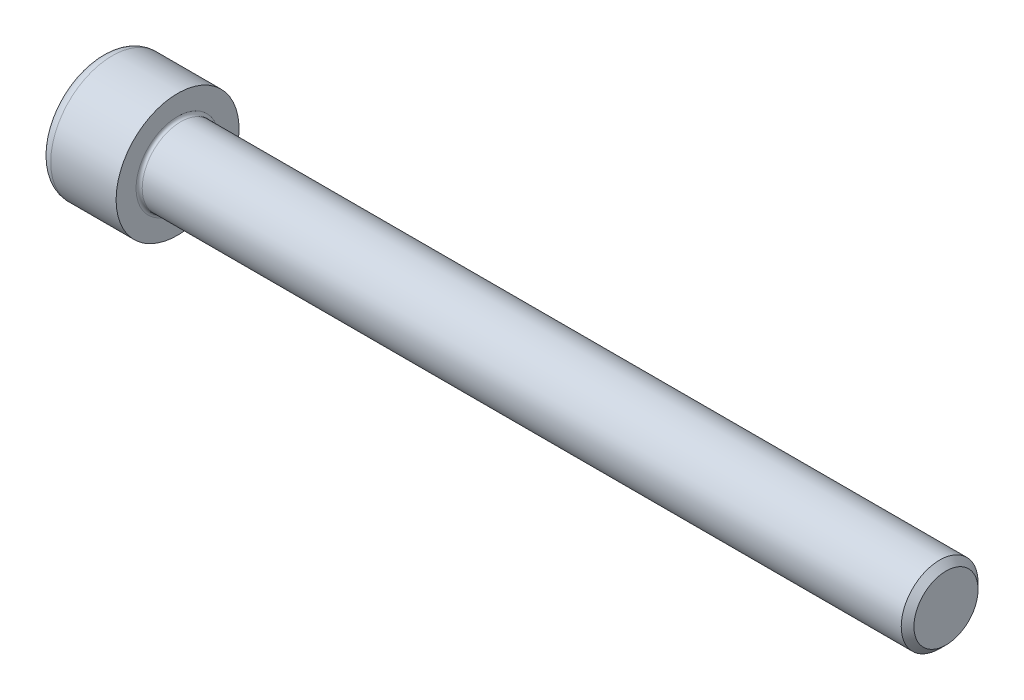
ISO-10303-21;
HEADER;
FILE_DESCRIPTION(('STEP AP214'),'2;1');
FILE_NAME('part.step','',(''),(''),'','','');
FILE_SCHEMA(('AUTOMOTIVE_DESIGN { 1 0 10303 214 1 1 1 1 }'));
ENDSEC;
DATA;
#1=APPLICATION_CONTEXT('core data for automotive mechanical design processes');
#2=APPLICATION_PROTOCOL_DEFINITION('international standard','automotive_design',2000,#1);
#3=PRODUCT_CONTEXT('',#1,'mechanical');
#4=PRODUCT('Part','Part','',(#3));
#5=PRODUCT_RELATED_PRODUCT_CATEGORY('part','',(#4));
#6=PRODUCT_DEFINITION_FORMATION('','',#4);
#7=PRODUCT_DEFINITION_CONTEXT('part definition',#1,'design');
#8=PRODUCT_DEFINITION('design','',#6,#7);
#9=PRODUCT_DEFINITION_SHAPE('','',#8);
#10=(LENGTH_UNIT() NAMED_UNIT(*) SI_UNIT(.MILLI.,.METRE.));
#11=(NAMED_UNIT(*) PLANE_ANGLE_UNIT() SI_UNIT($,.RADIAN.));
#12=(NAMED_UNIT(*) SI_UNIT($,.STERADIAN.) SOLID_ANGLE_UNIT());
#13=UNCERTAINTY_MEASURE_WITH_UNIT(LENGTH_MEASURE(1.E-05),#10,'distance_accuracy_value','');
#14=(GEOMETRIC_REPRESENTATION_CONTEXT(3) GLOBAL_UNCERTAINTY_ASSIGNED_CONTEXT((#13)) GLOBAL_UNIT_ASSIGNED_CONTEXT((#10,
#11,#12)) REPRESENTATION_CONTEXT('',''));
#15=CARTESIAN_POINT('',(0.,0.,0.));
#16=DIRECTION('',(0.,0.,1.));
#17=DIRECTION('',(1.,0.,0.));
#18=AXIS2_PLACEMENT_3D('',#15,#16,#17);
#19=CARTESIAN_POINT('',(0.,0.,0.));
#20=DIRECTION('',(-1.,0.,0.));
#21=DIRECTION('',(0.,0.,1.));
#22=AXIS2_PLACEMENT_3D('',#19,#20,#21);
#23=PLANE('',#22);
#24=DIRECTION('',(0.,-0.499999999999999,0.866025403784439));
#25=VECTOR('',#24,1.);
#26=CARTESIAN_POINT('',(0.,4.68519743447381,0.));
#27=LINE('',#26,#25);
#28=CARTESIAN_POINT('',(0.,4.68519743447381,0.));
#29=VERTEX_POINT('',#28);
#30=CARTESIAN_POINT('',(0.,2.34259871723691,4.05749999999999));
#31=VERTEX_POINT('',#30);
#32=EDGE_CURVE('E259',#29,#31,#27,.T.);
#33=ORIENTED_EDGE('',*,*,#32,.T.);
#34=DIRECTION('',(0.,1.,0.));
#35=VECTOR('',#34,1.);
#36=CARTESIAN_POINT('',(0.,-2.34259871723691,4.0575));
#37=LINE('',#36,#35);
#38=CARTESIAN_POINT('',(0.,-2.34259871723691,4.0575));
#39=VERTEX_POINT('',#38);
#40=EDGE_CURVE('E131',#39,#31,#37,.T.);
#41=ORIENTED_EDGE('',*,*,#40,.F.);
#42=DIRECTION('',(0.,-0.500000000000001,-0.866025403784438));
#43=VECTOR('',#42,1.);
#44=CARTESIAN_POINT('',(0.,-2.34259871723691,4.0575));
#45=LINE('',#44,#43);
#46=CARTESIAN_POINT('',(0.,-4.68519743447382,0.));
#47=VERTEX_POINT('',#46);
#48=EDGE_CURVE('E262',#39,#47,#45,.T.);
#49=ORIENTED_EDGE('',*,*,#48,.T.);
#50=DIRECTION('',(0.,0.499999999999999,-0.866025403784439));
#51=VECTOR('',#50,1.);
#52=CARTESIAN_POINT('',(0.,-4.68519743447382,0.));
#53=LINE('',#52,#51);
#54=CARTESIAN_POINT('',(0.,-2.34259871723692,-4.0575));
#55=VERTEX_POINT('',#54);
#56=EDGE_CURVE('E265',#47,#55,#53,.T.);
#57=ORIENTED_EDGE('',*,*,#56,.T.);
#58=DIRECTION('',(0.,-1.,0.));
#59=VECTOR('',#58,1.);
#60=CARTESIAN_POINT('',(0.,2.3425987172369,-4.05750000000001));
#61=LINE('',#60,#59);
#62=CARTESIAN_POINT('',(0.,2.3425987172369,-4.05750000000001));
#63=VERTEX_POINT('',#62);
#64=EDGE_CURVE('E268',#63,#55,#61,.T.);
#65=ORIENTED_EDGE('',*,*,#64,.F.);
#66=DIRECTION('',(0.,-0.500000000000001,-0.866025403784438));
#67=VECTOR('',#66,1.);
#68=CARTESIAN_POINT('',(0.,4.68519743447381,0.));
#69=LINE('',#68,#67);
#70=EDGE_CURVE('E126',#29,#63,#69,.T.);
#71=ORIENTED_EDGE('',*,*,#70,.F.);
#72=EDGE_LOOP('',(#33,#41,#49,#57,#65,#71));
#73=FACE_BOUND('',#72,.T.);
#74=CARTESIAN_POINT('',(0.,0.,0.));
#75=DIRECTION('',(-1.,0.,0.));
#76=DIRECTION('',(0.,0.,1.));
#77=AXIS2_PLACEMENT_3D('',#74,#75,#76);
#78=CIRCLE('',#77,6.5);
#79=CARTESIAN_POINT('',(0.,0.,6.5));
#80=VERTEX_POINT('',#79);
#81=EDGE_CURVE('E43',#80,#80,#78,.T.);
#82=ORIENTED_EDGE('',*,*,#81,.T.);
#83=EDGE_LOOP('',(#82));
#84=FACE_BOUND('',#83,.T.);
#85=ADVANCED_FACE('F35',(#73,#84),#23,.T.);
#86=CARTESIAN_POINT('',(-31.75,0.,0.));
#87=DIRECTION('',(-1.,0.,0.));
#88=DIRECTION('',(0.,0.,1.));
#89=AXIS2_PLACEMENT_3D('',#86,#87,#88);
#90=CYLINDRICAL_SURFACE('',#89,8.);
#91=CARTESIAN_POINT('',(1.5,0.,0.));
#92=DIRECTION('',(-1.,0.,0.));
#93=DIRECTION('',(0.,0.,1.));
#94=AXIS2_PLACEMENT_3D('',#91,#92,#93);
#95=CIRCLE('',#94,8.);
#96=CARTESIAN_POINT('',(1.5,0.,8.));
#97=VERTEX_POINT('',#96);
#98=EDGE_CURVE('E11',#97,#97,#95,.F.);
#99=ORIENTED_EDGE('',*,*,#98,.T.);
#100=EDGE_LOOP('',(#99));
#101=FACE_BOUND('',#100,.T.);
#102=CARTESIAN_POINT('',(10.,0.,0.));
#103=DIRECTION('',(-1.,0.,0.));
#104=DIRECTION('',(0.,0.,1.));
#105=AXIS2_PLACEMENT_3D('',#102,#103,#104);
#106=CIRCLE('',#105,8.);
#107=CARTESIAN_POINT('',(10.,0.,8.));
#108=VERTEX_POINT('',#107);
#109=EDGE_CURVE('E149',#108,#108,#106,.T.);
#110=ORIENTED_EDGE('',*,*,#109,.T.);
#111=EDGE_LOOP('',(#110));
#112=FACE_BOUND('',#111,.T.);
#113=ADVANCED_FACE('F173',(#101,#112),#90,.T.);
#114=CARTESIAN_POINT('',(10.,8.,0.));
#115=DIRECTION('',(1.,0.,0.));
#116=DIRECTION('',(0.,0.,-1.));
#117=AXIS2_PLACEMENT_3D('',#114,#115,#116);
#118=PLANE('',#117);
#119=CARTESIAN_POINT('',(10.,0.,0.));
#120=DIRECTION('',(1.,0.,0.));
#121=DIRECTION('',(0.,0.,-1.));
#122=AXIS2_PLACEMENT_3D('',#119,#120,#121);
#123=CIRCLE('',#122,5.39999999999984);
#124=CARTESIAN_POINT('',(10.,0.,-5.39999999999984));
#125=VERTEX_POINT('',#124);
#126=EDGE_CURVE('E152',#125,#125,#123,.F.);
#127=ORIENTED_EDGE('',*,*,#126,.T.);
#128=EDGE_LOOP('',(#127));
#129=FACE_BOUND('',#128,.T.);
#130=ORIENTED_EDGE('',*,*,#109,.F.);
#131=EDGE_LOOP('',(#130));
#132=FACE_BOUND('',#131,.T.);
#133=ADVANCED_FACE('F179',(#129,#132),#118,.T.);
#134=CARTESIAN_POINT('',(-31.75,0.,0.));
#135=DIRECTION('',(-1.,0.,0.));
#136=DIRECTION('',(0.,0.,1.));
#137=AXIS2_PLACEMENT_3D('',#134,#135,#136);
#138=CYLINDRICAL_SURFACE('',#137,4.99999999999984);
#139=CARTESIAN_POINT('',(10.4,0.,0.));
#140=DIRECTION('',(1.,0.,0.));
#141=DIRECTION('',(0.,0.,-1.));
#142=AXIS2_PLACEMENT_3D('',#139,#140,#141);
#143=CIRCLE('',#142,4.99999999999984);
#144=CARTESIAN_POINT('',(10.4,0.,-4.99999999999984));
#145=VERTEX_POINT('',#144);
#146=EDGE_CURVE('E155',#145,#145,#143,.T.);
#147=ORIENTED_EDGE('',*,*,#146,.T.);
#148=EDGE_LOOP('',(#147));
#149=FACE_BOUND('',#148,.T.);
#150=CARTESIAN_POINT('',(109.172,0.,0.));
#151=DIRECTION('',(-1.,0.,0.));
#152=DIRECTION('',(0.,0.,1.));
#153=AXIS2_PLACEMENT_3D('',#150,#151,#152);
#154=CIRCLE('',#153,4.99999999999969);
#155=CARTESIAN_POINT('',(109.172,0.,4.99999999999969));
#156=VERTEX_POINT('',#155);
#157=EDGE_CURVE('E146',#156,#156,#154,.T.);
#158=ORIENTED_EDGE('',*,*,#157,.T.);
#159=EDGE_LOOP('',(#158));
#160=FACE_BOUND('',#159,.T.);
#161=ADVANCED_FACE('F185',(#149,#160),#138,.T.);
#162=CARTESIAN_POINT('',(110.,0.,0.));
#163=DIRECTION('',(-1.,0.,0.));
#164=DIRECTION('',(0.,0.,1.));
#165=AXIS2_PLACEMENT_3D('',#162,#163,#164);
#166=CONICAL_SURFACE('',#165,4.172,0.785398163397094);
#167=ORIENTED_EDGE('',*,*,#157,.F.);
#168=EDGE_LOOP('',(#167));
#169=FACE_BOUND('',#168,.T.);
#170=CARTESIAN_POINT('',(110.,0.,0.));
#171=DIRECTION('',(-1.,0.,0.));
#172=DIRECTION('',(0.,0.,1.));
#173=AXIS2_PLACEMENT_3D('',#170,#171,#172);
#174=CIRCLE('',#173,4.172);
#175=CARTESIAN_POINT('',(110.,0.,4.172));
#176=VERTEX_POINT('',#175);
#177=EDGE_CURVE('E142',#176,#176,#174,.T.);
#178=ORIENTED_EDGE('',*,*,#177,.T.);
#179=EDGE_LOOP('',(#178));
#180=FACE_BOUND('',#179,.T.);
#181=ADVANCED_FACE('F189',(#169,#180),#166,.T.);
#182=CARTESIAN_POINT('',(110.,4.172,0.));
#183=DIRECTION('',(1.,0.,0.));
#184=DIRECTION('',(0.,0.,-1.));
#185=AXIS2_PLACEMENT_3D('',#182,#183,#184);
#186=PLANE('',#185);
#187=ORIENTED_EDGE('',*,*,#177,.F.);
#188=EDGE_LOOP('',(#187));
#189=FACE_BOUND('',#188,.T.);
#190=ADVANCED_FACE('F169',(#189),#186,.T.);
#191=CARTESIAN_POINT('',(10.4,0.,0.));
#192=DIRECTION('',(1.,0.,0.));
#193=DIRECTION('',(0.,0.,-1.));
#194=AXIS2_PLACEMENT_3D('',#191,#192,#193);
#195=TOROIDAL_SURFACE('',#194,5.39999999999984,0.4);
#196=ORIENTED_EDGE('',*,*,#146,.F.);
#197=EDGE_LOOP('',(#196));
#198=FACE_BOUND('',#197,.T.);
#199=ORIENTED_EDGE('',*,*,#126,.F.);
#200=EDGE_LOOP('',(#199));
#201=FACE_BOUND('',#200,.T.);
#202=ADVANCED_FACE('F162',(#198,#201),#195,.F.);
#203=CARTESIAN_POINT('',(1.5,0.,0.));
#204=DIRECTION('',(-1.,0.,0.));
#205=DIRECTION('',(0.,0.,1.));
#206=AXIS2_PLACEMENT_3D('',#203,#204,#205);
#207=TOROIDAL_SURFACE('',#206,6.5,1.5);
#208=ORIENTED_EDGE('',*,*,#98,.F.);
#209=EDGE_LOOP('',(#208));
#210=FACE_BOUND('',#209,.T.);
#211=ORIENTED_EDGE('',*,*,#81,.F.);
#212=EDGE_LOOP('',(#211));
#213=FACE_BOUND('',#212,.T.);
#214=ADVANCED_FACE('F37',(#210,#213),#207,.T.);
#215=CARTESIAN_POINT('',(5.,4.68519743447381,0.));
#216=DIRECTION('',(0.,-0.866025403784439,-0.499999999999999));
#217=DIRECTION('',(0.,0.499999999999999,-0.866025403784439));
#218=AXIS2_PLACEMENT_3D('',#215,#216,#217);
#219=PLANE('',#218);
#220=ORIENTED_EDGE('',*,*,#32,.F.);
#221=DIRECTION('',(-1.,0.,0.));
#222=VECTOR('',#221,1.);
#223=CARTESIAN_POINT('',(5.,4.68519743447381,0.));
#224=LINE('',#223,#222);
#225=CARTESIAN_POINT('',(5.,4.68519743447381,0.));
#226=VERTEX_POINT('',#225);
#227=EDGE_CURVE('E249',#226,#29,#224,.T.);
#228=ORIENTED_EDGE('',*,*,#227,.F.);
#229=DIRECTION('',(0.,-0.499999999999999,0.866025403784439));
#230=VECTOR('',#229,1.);
#231=CARTESIAN_POINT('',(5.,4.68519743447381,0.));
#232=LINE('',#231,#230);
#233=CARTESIAN_POINT('',(5.,3.51389807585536,2.02874999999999));
#234=VERTEX_POINT('',#233);
#235=EDGE_CURVE('E118',#226,#234,#232,.T.);
#236=ORIENTED_EDGE('',*,*,#235,.T.);
#237=CARTESIAN_POINT('',(5.,2.34259871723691,4.05749999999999));
#238=VERTEX_POINT('',#237);
#239=EDGE_CURVE('E109',#234,#238,#232,.T.);
#240=ORIENTED_EDGE('',*,*,#239,.T.);
#241=DIRECTION('',(-1.,0.,0.));
#242=VECTOR('',#241,1.);
#243=CARTESIAN_POINT('',(5.,2.34259871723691,4.05749999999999));
#244=LINE('',#243,#242);
#245=EDGE_CURVE('E123',#238,#31,#244,.T.);
#246=ORIENTED_EDGE('',*,*,#245,.T.);
#247=EDGE_LOOP('',(#220,#228,#236,#240,#246));
#248=FACE_BOUND('',#247,.T.);
#249=ADVANCED_FACE('F122',(#248),#219,.T.);
#250=CARTESIAN_POINT('',(5.,-2.34259871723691,4.0575));
#251=DIRECTION('',(0.,0.,1.));
#252=DIRECTION('',(0.,-1.,0.));
#253=AXIS2_PLACEMENT_3D('',#250,#251,#252);
#254=PLANE('',#253);
#255=ORIENTED_EDGE('',*,*,#40,.T.);
#256=ORIENTED_EDGE('',*,*,#245,.F.);
#257=DIRECTION('',(0.,1.,0.));
#258=VECTOR('',#257,1.);
#259=CARTESIAN_POINT('',(5.,-2.34259871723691,4.0575));
#260=LINE('',#259,#258);
#261=CARTESIAN_POINT('',(5.,0.,4.0575));
#262=VERTEX_POINT('',#261);
#263=EDGE_CURVE('E106',#262,#238,#260,.T.);
#264=ORIENTED_EDGE('',*,*,#263,.F.);
#265=CARTESIAN_POINT('',(5.,-2.34259871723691,4.0575));
#266=VERTEX_POINT('',#265);
#267=EDGE_CURVE('E117',#266,#262,#260,.T.);
#268=ORIENTED_EDGE('',*,*,#267,.F.);
#269=DIRECTION('',(-1.,0.,0.));
#270=VECTOR('',#269,1.);
#271=CARTESIAN_POINT('',(5.,-2.34259871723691,4.0575));
#272=LINE('',#271,#270);
#273=EDGE_CURVE('E133',#266,#39,#272,.T.);
#274=ORIENTED_EDGE('',*,*,#273,.T.);
#275=EDGE_LOOP('',(#255,#256,#264,#268,#274));
#276=FACE_BOUND('',#275,.T.);
#277=ADVANCED_FACE('F128',(#276),#254,.F.);
#278=CARTESIAN_POINT('',(5.,-2.34259871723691,4.0575));
#279=DIRECTION('',(0.,0.866025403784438,-0.500000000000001));
#280=DIRECTION('',(0.,0.500000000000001,0.866025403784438));
#281=AXIS2_PLACEMENT_3D('',#278,#279,#280);
#282=PLANE('',#281);
#283=ORIENTED_EDGE('',*,*,#48,.F.);
#284=ORIENTED_EDGE('',*,*,#273,.F.);
#285=DIRECTION('',(0.,-0.500000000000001,-0.866025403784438));
#286=VECTOR('',#285,1.);
#287=CARTESIAN_POINT('',(5.,-2.34259871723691,4.0575));
#288=LINE('',#287,#286);
#289=CARTESIAN_POINT('',(5.,-3.51389807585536,2.02875000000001));
#290=VERTEX_POINT('',#289);
#291=EDGE_CURVE('E288',#266,#290,#288,.T.);
#292=ORIENTED_EDGE('',*,*,#291,.T.);
#293=CARTESIAN_POINT('',(5.,-4.68519743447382,0.));
#294=VERTEX_POINT('',#293);
#295=EDGE_CURVE('E277',#290,#294,#288,.T.);
#296=ORIENTED_EDGE('',*,*,#295,.T.);
#297=DIRECTION('',(-1.,0.,0.));
#298=VECTOR('',#297,1.);
#299=CARTESIAN_POINT('',(5.,-4.68519743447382,0.));
#300=LINE('',#299,#298);
#301=EDGE_CURVE('E138',#294,#47,#300,.T.);
#302=ORIENTED_EDGE('',*,*,#301,.T.);
#303=EDGE_LOOP('',(#283,#284,#292,#296,#302));
#304=FACE_BOUND('',#303,.T.);
#305=ADVANCED_FACE('F203',(#304),#282,.T.);
#306=CARTESIAN_POINT('',(5.,-4.68519743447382,0.));
#307=DIRECTION('',(0.,0.866025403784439,0.499999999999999));
#308=DIRECTION('',(0.,-0.499999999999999,0.866025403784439));
#309=AXIS2_PLACEMENT_3D('',#306,#307,#308);
#310=PLANE('',#309);
#311=ORIENTED_EDGE('',*,*,#56,.F.);
#312=ORIENTED_EDGE('',*,*,#301,.F.);
#313=DIRECTION('',(0.,0.499999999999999,-0.866025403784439));
#314=VECTOR('',#313,1.);
#315=CARTESIAN_POINT('',(5.,-4.68519743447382,0.));
#316=LINE('',#315,#314);
#317=CARTESIAN_POINT('',(5.,-3.51389807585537,-2.02875));
#318=VERTEX_POINT('',#317);
#319=EDGE_CURVE('E255',#294,#318,#316,.T.);
#320=ORIENTED_EDGE('',*,*,#319,.T.);
#321=CARTESIAN_POINT('',(5.,-2.34259871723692,-4.0575));
#322=VERTEX_POINT('',#321);
#323=EDGE_CURVE('E287',#318,#322,#316,.T.);
#324=ORIENTED_EDGE('',*,*,#323,.T.);
#325=DIRECTION('',(-1.,0.,0.));
#326=VECTOR('',#325,1.);
#327=CARTESIAN_POINT('',(5.,-2.34259871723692,-4.0575));
#328=LINE('',#327,#326);
#329=EDGE_CURVE('E248',#322,#55,#328,.T.);
#330=ORIENTED_EDGE('',*,*,#329,.T.);
#331=EDGE_LOOP('',(#311,#312,#320,#324,#330));
#332=FACE_BOUND('',#331,.T.);
#333=ADVANCED_FACE('F206',(#332),#310,.T.);
#334=CARTESIAN_POINT('',(5.,2.3425987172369,-4.05750000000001));
#335=DIRECTION('',(0.,0.,-1.));
#336=DIRECTION('',(0.,1.,0.));
#337=AXIS2_PLACEMENT_3D('',#334,#335,#336);
#338=PLANE('',#337);
#339=ORIENTED_EDGE('',*,*,#64,.T.);
#340=ORIENTED_EDGE('',*,*,#329,.F.);
#341=DIRECTION('',(0.,-1.,0.));
#342=VECTOR('',#341,1.);
#343=CARTESIAN_POINT('',(5.,2.3425987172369,-4.05750000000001));
#344=LINE('',#343,#342);
#345=CARTESIAN_POINT('',(5.,0.,-4.0575));
#346=VERTEX_POINT('',#345);
#347=EDGE_CURVE('E252',#346,#322,#344,.T.);
#348=ORIENTED_EDGE('',*,*,#347,.F.);
#349=CARTESIAN_POINT('',(5.,2.3425987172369,-4.05750000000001));
#350=VERTEX_POINT('',#349);
#351=EDGE_CURVE('E50',#350,#346,#344,.T.);
#352=ORIENTED_EDGE('',*,*,#351,.F.);
#353=DIRECTION('',(-1.,0.,0.));
#354=VECTOR('',#353,1.);
#355=CARTESIAN_POINT('',(5.,2.3425987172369,-4.05750000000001));
#356=LINE('',#355,#354);
#357=EDGE_CURVE('E245',#350,#63,#356,.T.);
#358=ORIENTED_EDGE('',*,*,#357,.T.);
#359=EDGE_LOOP('',(#339,#340,#348,#352,#358));
#360=FACE_BOUND('',#359,.T.);
#361=ADVANCED_FACE('F210',(#360),#338,.F.);
#362=CARTESIAN_POINT('',(5.,4.68519743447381,0.));
#363=DIRECTION('',(0.,0.866025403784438,-0.500000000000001));
#364=DIRECTION('',(0.,0.500000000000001,0.866025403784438));
#365=AXIS2_PLACEMENT_3D('',#362,#363,#364);
#366=PLANE('',#365);
#367=ORIENTED_EDGE('',*,*,#70,.T.);
#368=ORIENTED_EDGE('',*,*,#357,.F.);
#369=DIRECTION('',(0.,-0.500000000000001,-0.866025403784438));
#370=VECTOR('',#369,1.);
#371=CARTESIAN_POINT('',(5.,4.68519743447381,0.));
#372=LINE('',#371,#370);
#373=CARTESIAN_POINT('',(5.,3.51389807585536,-2.02875));
#374=VERTEX_POINT('',#373);
#375=EDGE_CURVE('E235',#374,#350,#372,.T.);
#376=ORIENTED_EDGE('',*,*,#375,.F.);
#377=EDGE_CURVE('E241',#226,#374,#372,.T.);
#378=ORIENTED_EDGE('',*,*,#377,.F.);
#379=ORIENTED_EDGE('',*,*,#227,.T.);
#380=EDGE_LOOP('',(#367,#368,#376,#378,#379));
#381=FACE_BOUND('',#380,.T.);
#382=ADVANCED_FACE('F214',(#381),#366,.F.);
#383=CARTESIAN_POINT('',(5.,7.02779615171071,-4.05750000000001));
#384=DIRECTION('',(1.,0.,0.));
#385=DIRECTION('',(0.,0.,-1.));
#386=AXIS2_PLACEMENT_3D('',#383,#384,#385);
#387=PLANE('',#386);
#388=ORIENTED_EDGE('',*,*,#347,.T.);
#389=ORIENTED_EDGE('',*,*,#323,.F.);
#390=CARTESIAN_POINT('',(5.,0.,0.));
#391=DIRECTION('',(-1.,0.,0.));
#392=DIRECTION('',(0.,0.,1.));
#393=AXIS2_PLACEMENT_3D('',#390,#391,#392);
#394=CIRCLE('',#393,4.0575);
#395=EDGE_CURVE('E283',#346,#318,#394,.T.);
#396=ORIENTED_EDGE('',*,*,#395,.F.);
#397=EDGE_LOOP('',(#388,#389,#396));
#398=FACE_BOUND('',#397,.T.);
#399=ADVANCED_FACE('F218',(#398),#387,.F.);
#400=ORIENTED_EDGE('',*,*,#319,.F.);
#401=ORIENTED_EDGE('',*,*,#295,.F.);
#402=EDGE_CURVE('E136',#318,#290,#394,.T.);
#403=ORIENTED_EDGE('',*,*,#402,.F.);
#404=EDGE_LOOP('',(#400,#401,#403));
#405=FACE_BOUND('',#404,.T.);
#406=ADVANCED_FACE('F221',(#405),#387,.F.);
#407=ORIENTED_EDGE('',*,*,#291,.F.);
#408=ORIENTED_EDGE('',*,*,#267,.T.);
#409=EDGE_CURVE('E132',#290,#262,#394,.T.);
#410=ORIENTED_EDGE('',*,*,#409,.F.);
#411=EDGE_LOOP('',(#407,#408,#410));
#412=FACE_BOUND('',#411,.T.);
#413=ADVANCED_FACE('F226',(#412),#387,.F.);
#414=ORIENTED_EDGE('',*,*,#263,.T.);
#415=ORIENTED_EDGE('',*,*,#239,.F.);
#416=EDGE_CURVE('E112',#262,#234,#394,.T.);
#417=ORIENTED_EDGE('',*,*,#416,.F.);
#418=EDGE_LOOP('',(#414,#415,#417));
#419=FACE_BOUND('',#418,.T.);
#420=ADVANCED_FACE('F108',(#419),#387,.F.);
#421=ORIENTED_EDGE('',*,*,#235,.F.);
#422=ORIENTED_EDGE('',*,*,#377,.T.);
#423=EDGE_CURVE('E143',#234,#374,#394,.T.);
#424=ORIENTED_EDGE('',*,*,#423,.F.);
#425=EDGE_LOOP('',(#421,#422,#424));
#426=FACE_BOUND('',#425,.T.);
#427=ADVANCED_FACE('F229',(#426),#387,.F.);
#428=ORIENTED_EDGE('',*,*,#375,.T.);
#429=ORIENTED_EDGE('',*,*,#351,.T.);
#430=EDGE_CURVE('E238',#374,#346,#394,.T.);
#431=ORIENTED_EDGE('',*,*,#430,.F.);
#432=EDGE_LOOP('',(#428,#429,#431));
#433=FACE_BOUND('',#432,.T.);
#434=ADVANCED_FACE('F199',(#433),#387,.F.);
#435=CARTESIAN_POINT('',(5.,0.,0.));
#436=DIRECTION('',(-1.,0.,0.));
#437=DIRECTION('',(0.,0.,1.));
#438=AXIS2_PLACEMENT_3D('',#435,#436,#437);
#439=CONICAL_SURFACE('',#438,4.0575,1.04719755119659);
#440=CARTESIAN_POINT('',(7.34259871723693,0.,0.));
#441=VERTEX_POINT('',#440);
#442=VERTEX_LOOP('',#441);
#443=FACE_BOUND('',#442,.T.);
#444=ORIENTED_EDGE('',*,*,#416,.T.);
#445=ORIENTED_EDGE('',*,*,#423,.T.);
#446=ORIENTED_EDGE('',*,*,#430,.T.);
#447=ORIENTED_EDGE('',*,*,#395,.T.);
#448=ORIENTED_EDGE('',*,*,#402,.T.);
#449=ORIENTED_EDGE('',*,*,#409,.T.);
#450=EDGE_LOOP('',(#444,#445,#446,#447,#448,#449));
#451=FACE_BOUND('',#450,.T.);
#452=ADVANCED_FACE('F197',(#443,#451),#439,.F.);
#453=CLOSED_SHELL('',(#85,#113,#133,#161,#181,#190,#202,#214,#249,#277,#305,#333,#361,#382,#399,
#406,#413,#420,#427,#434,#452));
#454=MANIFOLD_SOLID_BREP('B2',#453);
#455=ADVANCED_BREP_SHAPE_REPRESENTATION('',(#18,#454),#14);
#456=SHAPE_DEFINITION_REPRESENTATION(#9,#455);
ENDSEC;
END-ISO-10303-21;
